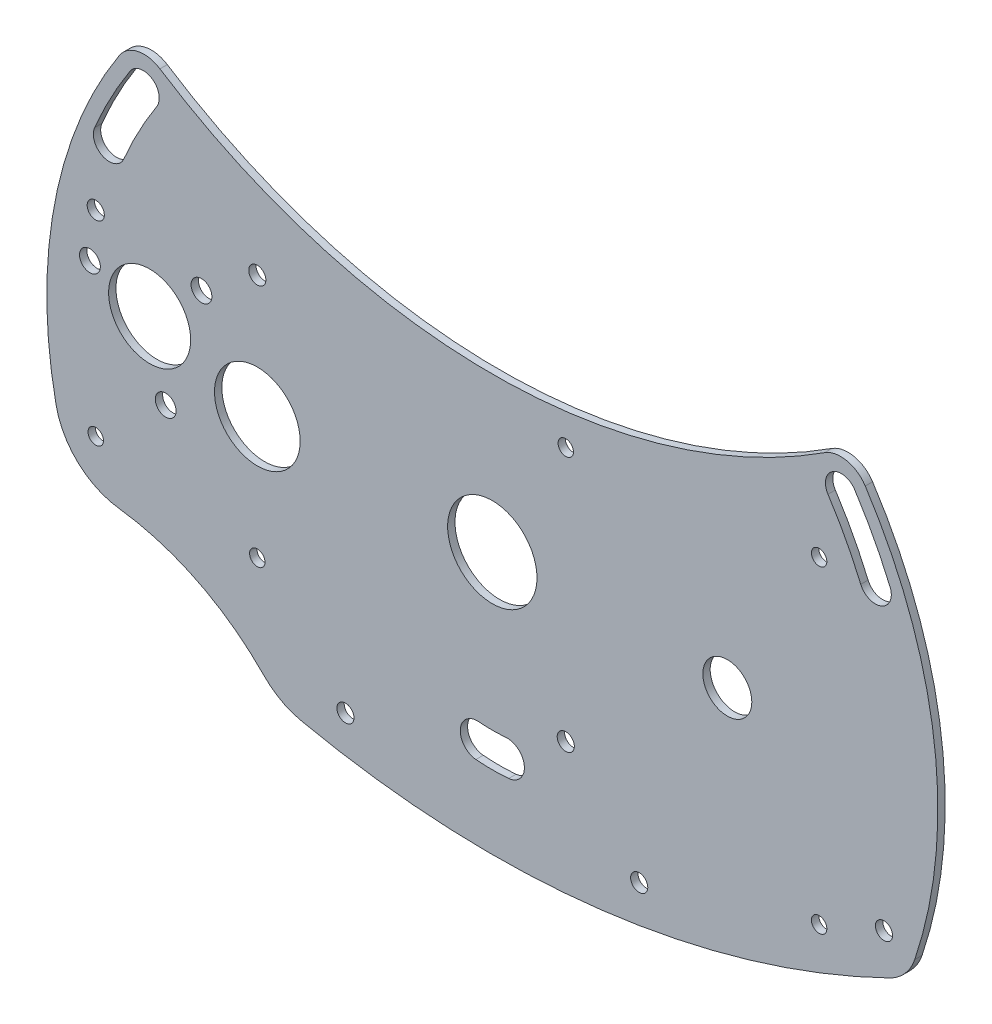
ISO-10303-21;
HEADER;
FILE_DESCRIPTION(('STEP AP214'),'2;1');
FILE_NAME('part.step','',(''),(''),'','','');
FILE_SCHEMA(('AUTOMOTIVE_DESIGN { 1 0 10303 214 1 1 1 1 }'));
ENDSEC;
DATA;
#1=APPLICATION_CONTEXT('core data for automotive mechanical design processes');
#2=APPLICATION_PROTOCOL_DEFINITION('international standard','automotive_design',2000,#1);
#3=PRODUCT_CONTEXT('',#1,'mechanical');
#4=PRODUCT('Part','Part','',(#3));
#5=PRODUCT_RELATED_PRODUCT_CATEGORY('part','',(#4));
#6=PRODUCT_DEFINITION_FORMATION('','',#4);
#7=PRODUCT_DEFINITION_CONTEXT('part definition',#1,'design');
#8=PRODUCT_DEFINITION('design','',#6,#7);
#9=PRODUCT_DEFINITION_SHAPE('','',#8);
#10=(LENGTH_UNIT() NAMED_UNIT(*) SI_UNIT(.MILLI.,.METRE.));
#11=(NAMED_UNIT(*) PLANE_ANGLE_UNIT() SI_UNIT($,.RADIAN.));
#12=(NAMED_UNIT(*) SI_UNIT($,.STERADIAN.) SOLID_ANGLE_UNIT());
#13=UNCERTAINTY_MEASURE_WITH_UNIT(LENGTH_MEASURE(1.E-05),#10,'distance_accuracy_value','');
#14=(GEOMETRIC_REPRESENTATION_CONTEXT(3) GLOBAL_UNCERTAINTY_ASSIGNED_CONTEXT((#13)) GLOBAL_UNIT_ASSIGNED_CONTEXT((#10,
#11,#12)) REPRESENTATION_CONTEXT('',''));
#15=CARTESIAN_POINT('',(0.,0.,0.));
#16=DIRECTION('',(0.,0.,1.));
#17=DIRECTION('',(1.,0.,0.));
#18=AXIS2_PLACEMENT_3D('',#15,#16,#17);
#19=CARTESIAN_POINT('',(71.1493499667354,-109.994408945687,3.));
#20=DIRECTION('',(0.,0.,1.));
#21=DIRECTION('',(1.,0.,0.));
#22=AXIS2_PLACEMENT_3D('',#19,#20,#21);
#23=PLANE('',#22);
#24=CARTESIAN_POINT('',(-60.,-399.892840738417,3.));
#25=DIRECTION('',(0.,0.,1.));
#26=DIRECTION('',(1.,0.,0.));
#27=AXIS2_PLACEMENT_3D('',#24,#25,#26);
#28=CIRCLE('',#27,3.50000000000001);
#29=CARTESIAN_POINT('',(-56.5,-399.892840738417,3.));
#30=VERTEX_POINT('',#29);
#31=EDGE_CURVE('E884',#30,#30,#28,.T.);
#32=ORIENTED_EDGE('',*,*,#31,.F.);
#33=EDGE_LOOP('',(#32));
#34=FACE_BOUND('',#33,.T.);
#35=CARTESIAN_POINT('',(59.9999999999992,-399.892840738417,3.));
#36=DIRECTION('',(0.,0.,1.));
#37=DIRECTION('',(1.,0.,0.));
#38=AXIS2_PLACEMENT_3D('',#35,#36,#37);
#39=CIRCLE('',#38,3.5);
#40=CARTESIAN_POINT('',(63.4999999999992,-399.892840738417,3.));
#41=VERTEX_POINT('',#40);
#42=EDGE_CURVE('E886',#41,#41,#39,.T.);
#43=ORIENTED_EDGE('',*,*,#42,.F.);
#44=EDGE_LOOP('',(#43));
#45=FACE_BOUND('',#44,.T.);
#46=CARTESIAN_POINT('',(159.999999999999,-366.899037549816,3.));
#47=DIRECTION('',(0.,0.,1.));
#48=DIRECTION('',(1.,0.,0.));
#49=AXIS2_PLACEMENT_3D('',#46,#47,#48);
#50=CIRCLE('',#49,3.50000000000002);
#51=CARTESIAN_POINT('',(163.499999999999,-366.899037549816,3.));
#52=VERTEX_POINT('',#51);
#53=EDGE_CURVE('E894',#52,#52,#50,.T.);
#54=ORIENTED_EDGE('',*,*,#53,.F.);
#55=EDGE_LOOP('',(#54));
#56=FACE_BOUND('',#55,.T.);
#57=CARTESIAN_POINT('',(6.10090199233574,-382.733628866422,3.));
#58=DIRECTION('',(0.,0.,1.));
#59=DIRECTION('',(-1.,0.,0.));
#60=AXIS2_PLACEMENT_3D('',#57,#58,#59);
#61=CIRCLE('',#60,7.00000000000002);
#62=CARTESIAN_POINT('',(6.71099219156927,-389.706991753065,3.));
#63=VERTEX_POINT('',#62);
#64=CARTESIAN_POINT('',(5.49081179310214,-375.76026597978,3.));
#65=VERTEX_POINT('',#64);
#66=EDGE_CURVE('E45',#63,#65,#61,.T.);
#67=ORIENTED_EDGE('',*,*,#66,.F.);
#68=CARTESIAN_POINT('',(0.,-313.,3.));
#69=DIRECTION('',(0.,0.,1.));
#70=DIRECTION('',(1.,0.,0.));
#71=AXIS2_PLACEMENT_3D('',#68,#69,#70);
#72=CIRCLE('',#71,77.);
#73=CARTESIAN_POINT('',(-6.71099219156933,-389.706991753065,3.));
#74=VERTEX_POINT('',#73);
#75=EDGE_CURVE('E196',#74,#63,#72,.T.);
#76=ORIENTED_EDGE('',*,*,#75,.F.);
#77=CARTESIAN_POINT('',(-6.10090199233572,-382.733628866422,3.));
#78=DIRECTION('',(0.,0.,1.));
#79=DIRECTION('',(1.,0.,0.));
#80=AXIS2_PLACEMENT_3D('',#77,#78,#79);
#81=CIRCLE('',#80,7.00000000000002);
#82=CARTESIAN_POINT('',(-5.49081179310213,-375.76026597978,3.));
#83=VERTEX_POINT('',#82);
#84=EDGE_CURVE('E181',#83,#74,#81,.T.);
#85=ORIENTED_EDGE('',*,*,#84,.F.);
#86=CARTESIAN_POINT('',(0.,-313.,3.));
#87=DIRECTION('',(0.,0.,-1.));
#88=DIRECTION('',(1.,0.,0.));
#89=AXIS2_PLACEMENT_3D('',#86,#87,#88);
#90=CIRCLE('',#89,63.);
#91=EDGE_CURVE('E190',#65,#83,#90,.T.);
#92=ORIENTED_EDGE('',*,*,#91,.F.);
#93=EDGE_LOOP('',(#67,#76,#85,#92));
#94=FACE_BOUND('',#93,.T.);
#95=CARTESIAN_POINT('',(0.,-313.,3.));
#96=DIRECTION('',(0.,0.,1.));
#97=DIRECTION('',(1.,0.,0.));
#98=AXIS2_PLACEMENT_3D('',#95,#96,#97);
#99=CIRCLE('',#98,176.5);
#100=CARTESIAN_POINT('',(162.469106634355,-244.035955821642,3.));
#101=VERTEX_POINT('',#100);
#102=CARTESIAN_POINT('',(148.025355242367,-216.871210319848,3.));
#103=VERTEX_POINT('',#102);
#104=EDGE_CURVE('E212',#101,#103,#99,.T.);
#105=ORIENTED_EDGE('',*,*,#104,.F.);
#106=CARTESIAN_POINT('',(156.485825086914,-246.575708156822,3.));
#107=DIRECTION('',(0.,0.,1.));
#108=DIRECTION('',(-1.,0.,0.));
#109=AXIS2_PLACEMENT_3D('',#106,#107,#108);
#110=CIRCLE('',#109,6.50000000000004);
#111=CARTESIAN_POINT('',(150.502543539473,-249.115460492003,3.));
#112=VERTEX_POINT('',#111);
#113=EDGE_CURVE('E222',#112,#101,#110,.T.);
#114=ORIENTED_EDGE('',*,*,#113,.F.);
#115=CARTESIAN_POINT('',(0.,-313.,3.));
#116=DIRECTION('',(0.,0.,-1.));
#117=DIRECTION('',(1.,0.,0.));
#118=AXIS2_PLACEMENT_3D('',#115,#116,#117);
#119=CIRCLE('',#118,163.5);
#120=CARTESIAN_POINT('',(137.122637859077,-223.951517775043,3.));
#121=VERTEX_POINT('',#120);
#122=EDGE_CURVE('E219',#121,#112,#119,.T.);
#123=ORIENTED_EDGE('',*,*,#122,.F.);
#124=CARTESIAN_POINT('',(142.573996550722,-220.411364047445,3.));
#125=DIRECTION('',(0.,0.,1.));
#126=DIRECTION('',(1.,0.,0.));
#127=AXIS2_PLACEMENT_3D('',#124,#125,#126);
#128=CIRCLE('',#127,6.50000000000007);
#129=EDGE_CURVE('E216',#103,#121,#128,.T.);
#130=ORIENTED_EDGE('',*,*,#129,.F.);
#131=EDGE_LOOP('',(#105,#114,#123,#130));
#132=FACE_BOUND('',#131,.T.);
#133=CARTESIAN_POINT('',(-156.485825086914,-246.575708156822,3.));
#134=DIRECTION('',(0.,0.,1.));
#135=DIRECTION('',(1.,0.,0.));
#136=AXIS2_PLACEMENT_3D('',#133,#134,#135);
#137=CIRCLE('',#136,6.50000000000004);
#138=CARTESIAN_POINT('',(-162.469106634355,-244.035955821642,3.));
#139=VERTEX_POINT('',#138);
#140=CARTESIAN_POINT('',(-150.502543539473,-249.115460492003,3.));
#141=VERTEX_POINT('',#140);
#142=EDGE_CURVE('E240',#139,#141,#137,.T.);
#143=ORIENTED_EDGE('',*,*,#142,.F.);
#144=CARTESIAN_POINT('',(0.,-313.,3.));
#145=DIRECTION('',(0.,0.,1.));
#146=DIRECTION('',(-1.,0.,0.));
#147=AXIS2_PLACEMENT_3D('',#144,#145,#146);
#148=CIRCLE('',#147,176.5);
#149=CARTESIAN_POINT('',(-148.025355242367,-216.871210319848,3.));
#150=VERTEX_POINT('',#149);
#151=EDGE_CURVE('E254',#150,#139,#148,.T.);
#152=ORIENTED_EDGE('',*,*,#151,.F.);
#153=CARTESIAN_POINT('',(-142.573996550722,-220.411364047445,3.));
#154=DIRECTION('',(0.,0.,1.));
#155=DIRECTION('',(-1.,0.,0.));
#156=AXIS2_PLACEMENT_3D('',#153,#154,#155);
#157=CIRCLE('',#156,6.50000000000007);
#158=CARTESIAN_POINT('',(-137.122637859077,-223.951517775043,3.));
#159=VERTEX_POINT('',#158);
#160=EDGE_CURVE('E251',#159,#150,#157,.T.);
#161=ORIENTED_EDGE('',*,*,#160,.F.);
#162=CARTESIAN_POINT('',(0.,-313.,3.));
#163=DIRECTION('',(0.,0.,-1.));
#164=DIRECTION('',(-1.,0.,0.));
#165=AXIS2_PLACEMENT_3D('',#162,#163,#164);
#166=CIRCLE('',#165,163.5);
#167=EDGE_CURVE('E248',#141,#159,#166,.T.);
#168=ORIENTED_EDGE('',*,*,#167,.F.);
#169=EDGE_LOOP('',(#143,#152,#161,#168));
#170=FACE_BOUND('',#169,.T.);
#171=CARTESIAN_POINT('',(-162.,-353.,3.));
#172=DIRECTION('',(0.,0.,1.));
#173=DIRECTION('',(1.,0.,0.));
#174=AXIS2_PLACEMENT_3D('',#171,#172,#173);
#175=CIRCLE('',#174,3.14999999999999);
#176=CARTESIAN_POINT('',(-158.85,-353.,3.));
#177=VERTEX_POINT('',#176);
#178=EDGE_CURVE('E272',#177,#177,#175,.T.);
#179=ORIENTED_EDGE('',*,*,#178,.F.);
#180=EDGE_LOOP('',(#179));
#181=FACE_BOUND('',#180,.T.);
#182=CARTESIAN_POINT('',(-162.,-273.,3.));
#183=DIRECTION('',(0.,0.,1.));
#184=DIRECTION('',(1.,0.,0.));
#185=AXIS2_PLACEMENT_3D('',#182,#183,#184);
#186=CIRCLE('',#185,3.49999999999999);
#187=CARTESIAN_POINT('',(-158.5,-273.,3.));
#188=VERTEX_POINT('',#187);
#189=EDGE_CURVE('E284',#188,#188,#186,.T.);
#190=ORIENTED_EDGE('',*,*,#189,.F.);
#191=EDGE_LOOP('',(#190));
#192=FACE_BOUND('',#191,.T.);
#193=CARTESIAN_POINT('',(-96.,-363.,3.));
#194=DIRECTION('',(0.,0.,1.));
#195=DIRECTION('',(1.,0.,0.));
#196=AXIS2_PLACEMENT_3D('',#193,#194,#195);
#197=CIRCLE('',#196,3.15);
#198=CARTESIAN_POINT('',(-92.85,-363.,3.));
#199=VERTEX_POINT('',#198);
#200=EDGE_CURVE('E290',#199,#199,#197,.T.);
#201=ORIENTED_EDGE('',*,*,#200,.F.);
#202=EDGE_LOOP('',(#201));
#203=FACE_BOUND('',#202,.T.);
#204=CARTESIAN_POINT('',(-96.,-263.,3.));
#205=DIRECTION('',(0.,0.,1.));
#206=DIRECTION('',(1.,0.,0.));
#207=AXIS2_PLACEMENT_3D('',#204,#205,#206);
#208=CIRCLE('',#207,3.50000000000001);
#209=CARTESIAN_POINT('',(-92.5,-263.,3.));
#210=VERTEX_POINT('',#209);
#211=EDGE_CURVE('E296',#210,#210,#208,.T.);
#212=ORIENTED_EDGE('',*,*,#211,.F.);
#213=EDGE_LOOP('',(#212));
#214=FACE_BOUND('',#213,.T.);
#215=CARTESIAN_POINT('',(133.5,-377.951905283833,3.));
#216=DIRECTION('',(0.,0.,1.));
#217=DIRECTION('',(1.,0.,0.));
#218=AXIS2_PLACEMENT_3D('',#215,#216,#217);
#219=CIRCLE('',#218,3.14999999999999);
#220=CARTESIAN_POINT('',(136.65,-377.951905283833,3.));
#221=VERTEX_POINT('',#220);
#222=EDGE_CURVE('E302',#221,#221,#219,.T.);
#223=ORIENTED_EDGE('',*,*,#222,.F.);
#224=EDGE_LOOP('',(#223));
#225=FACE_BOUND('',#224,.T.);
#226=CARTESIAN_POINT('',(133.5,-248.048094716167,3.));
#227=DIRECTION('',(0.,0.,1.));
#228=DIRECTION('',(1.,0.,0.));
#229=AXIS2_PLACEMENT_3D('',#226,#227,#228);
#230=CIRCLE('',#229,3.14999999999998);
#231=CARTESIAN_POINT('',(136.65,-248.048094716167,3.));
#232=VERTEX_POINT('',#231);
#233=EDGE_CURVE('E308',#232,#232,#230,.T.);
#234=ORIENTED_EDGE('',*,*,#233,.F.);
#235=EDGE_LOOP('',(#234));
#236=FACE_BOUND('',#235,.T.);
#237=CARTESIAN_POINT('',(30.,-365.,3.));
#238=DIRECTION('',(0.,0.,1.));
#239=DIRECTION('',(1.,0.,0.));
#240=AXIS2_PLACEMENT_3D('',#237,#238,#239);
#241=CIRCLE('',#240,3.5);
#242=CARTESIAN_POINT('',(33.5,-365.,3.));
#243=VERTEX_POINT('',#242);
#244=EDGE_CURVE('E314',#243,#243,#241,.T.);
#245=ORIENTED_EDGE('',*,*,#244,.F.);
#246=EDGE_LOOP('',(#245));
#247=FACE_BOUND('',#246,.T.);
#248=CARTESIAN_POINT('',(30.,-261.,3.));
#249=DIRECTION('',(0.,0.,1.));
#250=DIRECTION('',(1.,0.,0.));
#251=AXIS2_PLACEMENT_3D('',#248,#249,#250);
#252=CIRCLE('',#251,3.15000000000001);
#253=CARTESIAN_POINT('',(33.15,-261.,3.));
#254=VERTEX_POINT('',#253);
#255=EDGE_CURVE('E320',#254,#254,#252,.T.);
#256=ORIENTED_EDGE('',*,*,#255,.F.);
#257=EDGE_LOOP('',(#256));
#258=FACE_BOUND('',#257,.T.);
#259=CARTESIAN_POINT('',(-118.814307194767,-279.882672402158,3.));
#260=DIRECTION('',(0.,0.,1.));
#261=DIRECTION('',(1.,0.,0.));
#262=AXIS2_PLACEMENT_3D('',#259,#260,#261);
#263=CIRCLE('',#262,4.25000000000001);
#264=CARTESIAN_POINT('',(-114.564307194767,-279.882672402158,3.));
#265=VERTEX_POINT('',#264);
#266=EDGE_CURVE('E335',#265,#265,#263,.T.);
#267=ORIENTED_EDGE('',*,*,#266,.F.);
#268=EDGE_LOOP('',(#267));
#269=FACE_BOUND('',#268,.T.);
#270=CARTESIAN_POINT('',(-139.9900187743,-299.550901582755,3.));
#271=DIRECTION('',(0.,0.,1.));
#272=DIRECTION('',(1.,0.,0.));
#273=AXIS2_PLACEMENT_3D('',#270,#271,#272);
#274=CIRCLE('',#273,16.75);
#275=CARTESIAN_POINT('',(-123.2400187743,-299.550901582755,3.));
#276=VERTEX_POINT('',#275);
#277=EDGE_CURVE('E347',#276,#276,#274,.T.);
#278=ORIENTED_EDGE('',*,*,#277,.F.);
#279=EDGE_LOOP('',(#278));
#280=FACE_BOUND('',#279,.T.);
#281=CARTESIAN_POINT('',(96.0000000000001,-313.,3.));
#282=DIRECTION('',(0.,0.,1.));
#283=DIRECTION('',(1.,0.,0.));
#284=AXIS2_PLACEMENT_3D('',#281,#282,#283);
#285=CIRCLE('',#284,10.);
#286=CARTESIAN_POINT('',(106.,-313.,3.));
#287=VERTEX_POINT('',#286);
#288=EDGE_CURVE('E359',#287,#287,#285,.T.);
#289=ORIENTED_EDGE('',*,*,#288,.F.);
#290=EDGE_LOOP('',(#289));
#291=FACE_BOUND('',#290,.T.);
#292=CARTESIAN_POINT('',(142.298699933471,-219.988817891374,3.));
#293=DIRECTION('',(0.,0.,1.));
#294=DIRECTION('',(1.,0.,0.));
#295=AXIS2_PLACEMENT_3D('',#292,#293,#294);
#296=CIRCLE('',#295,12.);
#297=CARTESIAN_POINT('',(152.343314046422,-213.423322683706,3.));
#298=VERTEX_POINT('',#297);
#299=CARTESIAN_POINT('',(135.781202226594,-209.912994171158,3.));
#300=VERTEX_POINT('',#299);
#301=EDGE_CURVE('E389',#298,#300,#296,.T.);
#302=ORIENTED_EDGE('',*,*,#301,.T.);
#303=CARTESIAN_POINT('',(0.,0.,3.));
#304=DIRECTION('',(0.,0.,-1.));
#305=DIRECTION('',(-1.,0.,0.));
#306=AXIS2_PLACEMENT_3D('',#303,#304,#305);
#307=CIRCLE('',#306,250.);
#308=CARTESIAN_POINT('',(-135.781202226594,-209.912994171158,3.));
#309=VERTEX_POINT('',#308);
#310=EDGE_CURVE('E392',#300,#309,#307,.T.);
#311=ORIENTED_EDGE('',*,*,#310,.T.);
#312=CARTESIAN_POINT('',(-142.298699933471,-219.988817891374,3.));
#313=DIRECTION('',(0.,0.,1.));
#314=DIRECTION('',(1.,0.,0.));
#315=AXIS2_PLACEMENT_3D('',#312,#313,#314);
#316=CIRCLE('',#315,12.);
#317=CARTESIAN_POINT('',(-152.343314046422,-213.423322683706,3.));
#318=VERTEX_POINT('',#317);
#319=EDGE_CURVE('E394',#309,#318,#316,.T.);
#320=ORIENTED_EDGE('',*,*,#319,.T.);
#321=CARTESIAN_POINT('',(0.,-313.,3.));
#322=DIRECTION('',(0.,0.,1.));
#323=DIRECTION('',(1.,0.,0.));
#324=AXIS2_PLACEMENT_3D('',#321,#322,#323);
#325=CIRCLE('',#324,182.);
#326=CARTESIAN_POINT('',(-178.171449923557,-350.134006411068,3.));
#327=VERTEX_POINT('',#326);
#328=EDGE_CURVE('E396',#318,#327,#325,.T.);
#329=ORIENTED_EDGE('',*,*,#328,.T.);
#330=CARTESIAN_POINT('',(-148.802529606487,-344.01301634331,3.));
#331=DIRECTION('',(0.,0.,1.));
#332=DIRECTION('',(-1.,0.,0.));
#333=AXIS2_PLACEMENT_3D('',#330,#331,#332);
#334=CIRCLE('',#333,30.);
#335=CARTESIAN_POINT('',(-152.540407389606,-373.779243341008,3.));
#336=VERTEX_POINT('',#335);
#337=EDGE_CURVE('E398',#327,#336,#334,.T.);
#338=ORIENTED_EDGE('',*,*,#337,.T.);
#339=CARTESIAN_POINT('',(-165.,-473.,3.));
#340=DIRECTION('',(0.,0.,-1.));
#341=DIRECTION('',(1.,0.,0.));
#342=AXIS2_PLACEMENT_3D('',#339,#340,#341);
#343=CIRCLE('',#342,100.);
#344=CARTESIAN_POINT('',(-93.3436090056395,-403.247855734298,3.));
#345=VERTEX_POINT('',#344);
#346=EDGE_CURVE('E400',#336,#345,#343,.T.);
#347=ORIENTED_EDGE('',*,*,#346,.T.);
#348=CARTESIAN_POINT('',(-71.8466917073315,-382.322212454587,3.));
#349=DIRECTION('',(0.,0.,1.));
#350=DIRECTION('',(-1.,0.,0.));
#351=AXIS2_PLACEMENT_3D('',#348,#349,#350);
#352=CIRCLE('',#351,30.);
#353=CARTESIAN_POINT('',(-78.186105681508,-411.644760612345,3.));
#354=VERTEX_POINT('',#353);
#355=EDGE_CURVE('E402',#345,#354,#352,.T.);
#356=ORIENTED_EDGE('',*,*,#355,.T.);
#357=CARTESIAN_POINT('',(0.,-50.,3.));
#358=DIRECTION('',(0.,0.,1.));
#359=DIRECTION('',(1.,0.,0.));
#360=AXIS2_PLACEMENT_3D('',#357,#358,#359);
#361=CIRCLE('',#360,370.);
#362=CARTESIAN_POINT('',(162.374326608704,-382.467409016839,3.));
#363=VERTEX_POINT('',#362);
#364=EDGE_CURVE('E404',#354,#363,#361,.T.);
#365=ORIENTED_EDGE('',*,*,#364,.T.);
#366=CARTESIAN_POINT('',(153.597335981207,-364.496197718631,3.));
#367=DIRECTION('',(0.,0.,1.));
#368=DIRECTION('',(1.,0.,0.));
#369=AXIS2_PLACEMENT_3D('',#366,#367,#368);
#370=CIRCLE('',#369,20.);
#371=CARTESIAN_POINT('',(172.559970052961,-370.853752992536,3.));
#372=VERTEX_POINT('',#371);
#373=EDGE_CURVE('E406',#363,#372,#370,.T.);
#374=ORIENTED_EDGE('',*,*,#373,.T.);
#375=CARTESIAN_POINT('',(0.,-313.,3.));
#376=DIRECTION('',(0.,0.,1.));
#377=DIRECTION('',(-1.,0.,0.));
#378=AXIS2_PLACEMENT_3D('',#375,#376,#377);
#379=CIRCLE('',#378,182.);
#380=EDGE_CURVE('E408',#372,#298,#379,.T.);
#381=ORIENTED_EDGE('',*,*,#380,.T.);
#382=EDGE_LOOP('',(#302,#311,#320,#329,#338,#347,#356,#365,#374,#381));
#383=FACE_BOUND('',#382,.T.);
#384=CARTESIAN_POINT('',(0.,-313.,3.));
#385=DIRECTION('',(0.,0.,1.));
#386=DIRECTION('',(1.,0.,0.));
#387=AXIS2_PLACEMENT_3D('',#384,#385,#386);
#388=CIRCLE('',#387,18.25);
#389=CARTESIAN_POINT('',(18.2500000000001,-313.,3.));
#390=VERTEX_POINT('',#389);
#391=EDGE_CURVE('E365',#390,#390,#388,.T.);
#392=ORIENTED_EDGE('',*,*,#391,.F.);
#393=EDGE_LOOP('',(#392));
#394=FACE_BOUND('',#393,.T.);
#395=CARTESIAN_POINT('',(-95.9999999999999,-313.,3.));
#396=DIRECTION('',(0.,0.,1.));
#397=DIRECTION('',(1.,0.,0.));
#398=AXIS2_PLACEMENT_3D('',#395,#396,#397);
#399=CIRCLE('',#398,17.5);
#400=CARTESIAN_POINT('',(-78.4999999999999,-313.,3.));
#401=VERTEX_POINT('',#400);
#402=EDGE_CURVE('E353',#401,#401,#399,.T.);
#403=ORIENTED_EDGE('',*,*,#402,.F.);
#404=EDGE_LOOP('',(#403));
#405=FACE_BOUND('',#404,.T.);
#406=CARTESIAN_POINT('',(-164.375790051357,-292.095423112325,3.));
#407=DIRECTION('',(0.,0.,1.));
#408=DIRECTION('',(1.,0.,0.));
#409=AXIS2_PLACEMENT_3D('',#406,#407,#408);
#410=CIRCLE('',#409,4.25000000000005);
#411=CARTESIAN_POINT('',(-160.125790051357,-292.095423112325,3.));
#412=VERTEX_POINT('',#411);
#413=EDGE_CURVE('E341',#412,#412,#410,.T.);
#414=ORIENTED_EDGE('',*,*,#413,.F.);
#415=EDGE_LOOP('',(#414));
#416=FACE_BOUND('',#415,.T.);
#417=CARTESIAN_POINT('',(-133.432892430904,-327.69791020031,3.));
#418=DIRECTION('',(0.,0.,1.));
#419=DIRECTION('',(1.,0.,0.));
#420=AXIS2_PLACEMENT_3D('',#417,#418,#419);
#421=CIRCLE('',#420,4.25000000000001);
#422=CARTESIAN_POINT('',(-129.182892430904,-327.69791020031,3.));
#423=VERTEX_POINT('',#422);
#424=EDGE_CURVE('E329',#423,#423,#421,.T.);
#425=ORIENTED_EDGE('',*,*,#424,.F.);
#426=EDGE_LOOP('',(#425));
#427=FACE_BOUND('',#426,.T.);
#428=ADVANCED_FACE('F30',(#34,#45,#56,#94,#132,#170,#181,#192,#203,#214,#225,#236,#247,#258,
#269,#280,#291,#383,#394,#405,#416,#427),#23,.T.);
#429=CARTESIAN_POINT('',(71.1493499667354,-109.994408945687,0.));
#430=DIRECTION('',(0.,0.,1.));
#431=DIRECTION('',(1.,0.,0.));
#432=AXIS2_PLACEMENT_3D('',#429,#430,#431);
#433=PLANE('',#432);
#434=CARTESIAN_POINT('',(-60.,-399.892840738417,0.));
#435=DIRECTION('',(0.,0.,1.));
#436=DIRECTION('',(1.,0.,0.));
#437=AXIS2_PLACEMENT_3D('',#434,#435,#436);
#438=CIRCLE('',#437,3.50000000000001);
#439=CARTESIAN_POINT('',(-56.5,-399.892840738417,0.));
#440=VERTEX_POINT('',#439);
#441=EDGE_CURVE('E882',#440,#440,#438,.T.);
#442=ORIENTED_EDGE('',*,*,#441,.T.);
#443=EDGE_LOOP('',(#442));
#444=FACE_BOUND('',#443,.T.);
#445=CARTESIAN_POINT('',(59.9999999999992,-399.892840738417,0.));
#446=DIRECTION('',(0.,0.,1.));
#447=DIRECTION('',(1.,0.,0.));
#448=AXIS2_PLACEMENT_3D('',#445,#446,#447);
#449=CIRCLE('',#448,3.5);
#450=CARTESIAN_POINT('',(63.4999999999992,-399.892840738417,0.));
#451=VERTEX_POINT('',#450);
#452=EDGE_CURVE('E891',#451,#451,#449,.T.);
#453=ORIENTED_EDGE('',*,*,#452,.T.);
#454=EDGE_LOOP('',(#453));
#455=FACE_BOUND('',#454,.T.);
#456=CARTESIAN_POINT('',(159.999999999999,-366.899037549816,0.));
#457=DIRECTION('',(0.,0.,1.));
#458=DIRECTION('',(1.,0.,0.));
#459=AXIS2_PLACEMENT_3D('',#456,#457,#458);
#460=CIRCLE('',#459,3.50000000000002);
#461=CARTESIAN_POINT('',(163.499999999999,-366.899037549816,0.));
#462=VERTEX_POINT('',#461);
#463=EDGE_CURVE('E897',#462,#462,#460,.T.);
#464=ORIENTED_EDGE('',*,*,#463,.T.);
#465=EDGE_LOOP('',(#464));
#466=FACE_BOUND('',#465,.T.);
#467=CARTESIAN_POINT('',(0.,-313.,0.));
#468=DIRECTION('',(0.,0.,1.));
#469=DIRECTION('',(1.,0.,0.));
#470=AXIS2_PLACEMENT_3D('',#467,#468,#469);
#471=CIRCLE('',#470,77.);
#472=CARTESIAN_POINT('',(-6.71099219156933,-389.706991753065,0.));
#473=VERTEX_POINT('',#472);
#474=CARTESIAN_POINT('',(6.71099219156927,-389.706991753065,0.));
#475=VERTEX_POINT('',#474);
#476=EDGE_CURVE('E207',#473,#475,#471,.T.);
#477=ORIENTED_EDGE('',*,*,#476,.T.);
#478=CARTESIAN_POINT('',(6.10090199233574,-382.733628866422,0.));
#479=DIRECTION('',(0.,0.,1.));
#480=DIRECTION('',(-1.,0.,0.));
#481=AXIS2_PLACEMENT_3D('',#478,#479,#480);
#482=CIRCLE('',#481,7.00000000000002);
#483=CARTESIAN_POINT('',(5.49081179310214,-375.76026597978,0.));
#484=VERTEX_POINT('',#483);
#485=EDGE_CURVE('E198',#475,#484,#482,.T.);
#486=ORIENTED_EDGE('',*,*,#485,.T.);
#487=CARTESIAN_POINT('',(0.,-313.,0.));
#488=DIRECTION('',(0.,0.,-1.));
#489=DIRECTION('',(1.,0.,0.));
#490=AXIS2_PLACEMENT_3D('',#487,#488,#489);
#491=CIRCLE('',#490,63.);
#492=CARTESIAN_POINT('',(-5.49081179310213,-375.76026597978,0.));
#493=VERTEX_POINT('',#492);
#494=EDGE_CURVE('E204',#484,#493,#491,.T.);
#495=ORIENTED_EDGE('',*,*,#494,.T.);
#496=CARTESIAN_POINT('',(-6.10090199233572,-382.733628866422,0.));
#497=DIRECTION('',(0.,0.,1.));
#498=DIRECTION('',(1.,0.,0.));
#499=AXIS2_PLACEMENT_3D('',#496,#497,#498);
#500=CIRCLE('',#499,7.00000000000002);
#501=EDGE_CURVE('E53',#493,#473,#500,.T.);
#502=ORIENTED_EDGE('',*,*,#501,.T.);
#503=EDGE_LOOP('',(#477,#486,#495,#502));
#504=FACE_BOUND('',#503,.T.);
#505=CARTESIAN_POINT('',(156.485825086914,-246.575708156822,0.));
#506=DIRECTION('',(0.,0.,1.));
#507=DIRECTION('',(-1.,0.,0.));
#508=AXIS2_PLACEMENT_3D('',#505,#506,#507);
#509=CIRCLE('',#508,6.50000000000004);
#510=CARTESIAN_POINT('',(150.502543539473,-249.115460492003,0.));
#511=VERTEX_POINT('',#510);
#512=CARTESIAN_POINT('',(162.469106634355,-244.035955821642,0.));
#513=VERTEX_POINT('',#512);
#514=EDGE_CURVE('E234',#511,#513,#509,.T.);
#515=ORIENTED_EDGE('',*,*,#514,.T.);
#516=CARTESIAN_POINT('',(0.,-313.,0.));
#517=DIRECTION('',(0.,0.,1.));
#518=DIRECTION('',(1.,0.,0.));
#519=AXIS2_PLACEMENT_3D('',#516,#517,#518);
#520=CIRCLE('',#519,176.5);
#521=CARTESIAN_POINT('',(148.025355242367,-216.871210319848,0.));
#522=VERTEX_POINT('',#521);
#523=EDGE_CURVE('E225',#513,#522,#520,.T.);
#524=ORIENTED_EDGE('',*,*,#523,.T.);
#525=CARTESIAN_POINT('',(142.573996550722,-220.411364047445,0.));
#526=DIRECTION('',(0.,0.,1.));
#527=DIRECTION('',(1.,0.,0.));
#528=AXIS2_PLACEMENT_3D('',#525,#526,#527);
#529=CIRCLE('',#528,6.50000000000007);
#530=CARTESIAN_POINT('',(137.122637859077,-223.951517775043,0.));
#531=VERTEX_POINT('',#530);
#532=EDGE_CURVE('E228',#522,#531,#529,.T.);
#533=ORIENTED_EDGE('',*,*,#532,.T.);
#534=CARTESIAN_POINT('',(0.,-313.,0.));
#535=DIRECTION('',(0.,0.,-1.));
#536=DIRECTION('',(1.,0.,0.));
#537=AXIS2_PLACEMENT_3D('',#534,#535,#536);
#538=CIRCLE('',#537,163.5);
#539=EDGE_CURVE('E231',#531,#511,#538,.T.);
#540=ORIENTED_EDGE('',*,*,#539,.T.);
#541=EDGE_LOOP('',(#515,#524,#533,#540));
#542=FACE_BOUND('',#541,.T.);
#543=CARTESIAN_POINT('',(0.,-313.,0.));
#544=DIRECTION('',(0.,0.,1.));
#545=DIRECTION('',(-1.,0.,0.));
#546=AXIS2_PLACEMENT_3D('',#543,#544,#545);
#547=CIRCLE('',#546,176.5);
#548=CARTESIAN_POINT('',(-148.025355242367,-216.871210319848,0.));
#549=VERTEX_POINT('',#548);
#550=CARTESIAN_POINT('',(-162.469106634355,-244.035955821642,0.));
#551=VERTEX_POINT('',#550);
#552=EDGE_CURVE('E266',#549,#551,#547,.T.);
#553=ORIENTED_EDGE('',*,*,#552,.T.);
#554=CARTESIAN_POINT('',(-156.485825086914,-246.575708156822,0.));
#555=DIRECTION('',(0.,0.,1.));
#556=DIRECTION('',(1.,0.,0.));
#557=AXIS2_PLACEMENT_3D('',#554,#555,#556);
#558=CIRCLE('',#557,6.50000000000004);
#559=CARTESIAN_POINT('',(-150.502543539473,-249.115460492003,0.));
#560=VERTEX_POINT('',#559);
#561=EDGE_CURVE('E257',#551,#560,#558,.T.);
#562=ORIENTED_EDGE('',*,*,#561,.T.);
#563=CARTESIAN_POINT('',(0.,-313.,0.));
#564=DIRECTION('',(0.,0.,-1.));
#565=DIRECTION('',(-1.,0.,0.));
#566=AXIS2_PLACEMENT_3D('',#563,#564,#565);
#567=CIRCLE('',#566,163.5);
#568=CARTESIAN_POINT('',(-137.122637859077,-223.951517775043,0.));
#569=VERTEX_POINT('',#568);
#570=EDGE_CURVE('E260',#560,#569,#567,.T.);
#571=ORIENTED_EDGE('',*,*,#570,.T.);
#572=CARTESIAN_POINT('',(-142.573996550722,-220.411364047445,0.));
#573=DIRECTION('',(0.,0.,1.));
#574=DIRECTION('',(-1.,0.,0.));
#575=AXIS2_PLACEMENT_3D('',#572,#573,#574);
#576=CIRCLE('',#575,6.50000000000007);
#577=EDGE_CURVE('E263',#569,#549,#576,.T.);
#578=ORIENTED_EDGE('',*,*,#577,.T.);
#579=EDGE_LOOP('',(#553,#562,#571,#578));
#580=FACE_BOUND('',#579,.T.);
#581=CARTESIAN_POINT('',(-162.,-353.,0.));
#582=DIRECTION('',(0.,0.,1.));
#583=DIRECTION('',(1.,0.,0.));
#584=AXIS2_PLACEMENT_3D('',#581,#582,#583);
#585=CIRCLE('',#584,3.14999999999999);
#586=CARTESIAN_POINT('',(-158.85,-353.,0.));
#587=VERTEX_POINT('',#586);
#588=EDGE_CURVE('E281',#587,#587,#585,.T.);
#589=ORIENTED_EDGE('',*,*,#588,.T.);
#590=EDGE_LOOP('',(#589));
#591=FACE_BOUND('',#590,.T.);
#592=CARTESIAN_POINT('',(-162.,-273.,0.));
#593=DIRECTION('',(0.,0.,1.));
#594=DIRECTION('',(1.,0.,0.));
#595=AXIS2_PLACEMENT_3D('',#592,#593,#594);
#596=CIRCLE('',#595,3.49999999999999);
#597=CARTESIAN_POINT('',(-158.5,-273.,0.));
#598=VERTEX_POINT('',#597);
#599=EDGE_CURVE('E287',#598,#598,#596,.T.);
#600=ORIENTED_EDGE('',*,*,#599,.T.);
#601=EDGE_LOOP('',(#600));
#602=FACE_BOUND('',#601,.T.);
#603=CARTESIAN_POINT('',(-96.,-363.,0.));
#604=DIRECTION('',(0.,0.,1.));
#605=DIRECTION('',(1.,0.,0.));
#606=AXIS2_PLACEMENT_3D('',#603,#604,#605);
#607=CIRCLE('',#606,3.15);
#608=CARTESIAN_POINT('',(-92.85,-363.,0.));
#609=VERTEX_POINT('',#608);
#610=EDGE_CURVE('E293',#609,#609,#607,.T.);
#611=ORIENTED_EDGE('',*,*,#610,.T.);
#612=EDGE_LOOP('',(#611));
#613=FACE_BOUND('',#612,.T.);
#614=CARTESIAN_POINT('',(-96.,-263.,0.));
#615=DIRECTION('',(0.,0.,1.));
#616=DIRECTION('',(1.,0.,0.));
#617=AXIS2_PLACEMENT_3D('',#614,#615,#616);
#618=CIRCLE('',#617,3.50000000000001);
#619=CARTESIAN_POINT('',(-92.5,-263.,0.));
#620=VERTEX_POINT('',#619);
#621=EDGE_CURVE('E299',#620,#620,#618,.T.);
#622=ORIENTED_EDGE('',*,*,#621,.T.);
#623=EDGE_LOOP('',(#622));
#624=FACE_BOUND('',#623,.T.);
#625=CARTESIAN_POINT('',(133.5,-377.951905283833,0.));
#626=DIRECTION('',(0.,0.,1.));
#627=DIRECTION('',(1.,0.,0.));
#628=AXIS2_PLACEMENT_3D('',#625,#626,#627);
#629=CIRCLE('',#628,3.14999999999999);
#630=CARTESIAN_POINT('',(136.65,-377.951905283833,0.));
#631=VERTEX_POINT('',#630);
#632=EDGE_CURVE('E305',#631,#631,#629,.T.);
#633=ORIENTED_EDGE('',*,*,#632,.T.);
#634=EDGE_LOOP('',(#633));
#635=FACE_BOUND('',#634,.T.);
#636=CARTESIAN_POINT('',(133.5,-248.048094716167,0.));
#637=DIRECTION('',(0.,0.,1.));
#638=DIRECTION('',(1.,0.,0.));
#639=AXIS2_PLACEMENT_3D('',#636,#637,#638);
#640=CIRCLE('',#639,3.14999999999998);
#641=CARTESIAN_POINT('',(136.65,-248.048094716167,0.));
#642=VERTEX_POINT('',#641);
#643=EDGE_CURVE('E311',#642,#642,#640,.T.);
#644=ORIENTED_EDGE('',*,*,#643,.T.);
#645=EDGE_LOOP('',(#644));
#646=FACE_BOUND('',#645,.T.);
#647=CARTESIAN_POINT('',(30.,-365.,0.));
#648=DIRECTION('',(0.,0.,1.));
#649=DIRECTION('',(1.,0.,0.));
#650=AXIS2_PLACEMENT_3D('',#647,#648,#649);
#651=CIRCLE('',#650,3.5);
#652=CARTESIAN_POINT('',(33.5,-365.,0.));
#653=VERTEX_POINT('',#652);
#654=EDGE_CURVE('E317',#653,#653,#651,.T.);
#655=ORIENTED_EDGE('',*,*,#654,.T.);
#656=EDGE_LOOP('',(#655));
#657=FACE_BOUND('',#656,.T.);
#658=CARTESIAN_POINT('',(30.,-261.,0.));
#659=DIRECTION('',(0.,0.,1.));
#660=DIRECTION('',(1.,0.,0.));
#661=AXIS2_PLACEMENT_3D('',#658,#659,#660);
#662=CIRCLE('',#661,3.15000000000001);
#663=CARTESIAN_POINT('',(33.15,-261.,0.));
#664=VERTEX_POINT('',#663);
#665=EDGE_CURVE('E323',#664,#664,#662,.T.);
#666=ORIENTED_EDGE('',*,*,#665,.T.);
#667=EDGE_LOOP('',(#666));
#668=FACE_BOUND('',#667,.T.);
#669=CARTESIAN_POINT('',(-118.814307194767,-279.882672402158,0.));
#670=DIRECTION('',(0.,0.,1.));
#671=DIRECTION('',(1.,0.,0.));
#672=AXIS2_PLACEMENT_3D('',#669,#670,#671);
#673=CIRCLE('',#672,4.25000000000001);
#674=CARTESIAN_POINT('',(-114.564307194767,-279.882672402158,0.));
#675=VERTEX_POINT('',#674);
#676=EDGE_CURVE('E332',#675,#675,#673,.T.);
#677=ORIENTED_EDGE('',*,*,#676,.T.);
#678=EDGE_LOOP('',(#677));
#679=FACE_BOUND('',#678,.T.);
#680=CARTESIAN_POINT('',(-139.9900187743,-299.550901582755,0.));
#681=DIRECTION('',(0.,0.,1.));
#682=DIRECTION('',(1.,0.,0.));
#683=AXIS2_PLACEMENT_3D('',#680,#681,#682);
#684=CIRCLE('',#683,16.75);
#685=CARTESIAN_POINT('',(-123.2400187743,-299.550901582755,0.));
#686=VERTEX_POINT('',#685);
#687=EDGE_CURVE('E344',#686,#686,#684,.T.);
#688=ORIENTED_EDGE('',*,*,#687,.T.);
#689=EDGE_LOOP('',(#688));
#690=FACE_BOUND('',#689,.T.);
#691=CARTESIAN_POINT('',(96.0000000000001,-313.,0.));
#692=DIRECTION('',(0.,0.,1.));
#693=DIRECTION('',(1.,0.,0.));
#694=AXIS2_PLACEMENT_3D('',#691,#692,#693);
#695=CIRCLE('',#694,10.);
#696=CARTESIAN_POINT('',(106.,-313.,0.));
#697=VERTEX_POINT('',#696);
#698=EDGE_CURVE('E356',#697,#697,#695,.T.);
#699=ORIENTED_EDGE('',*,*,#698,.T.);
#700=EDGE_LOOP('',(#699));
#701=FACE_BOUND('',#700,.T.);
#702=CARTESIAN_POINT('',(142.298699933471,-219.988817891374,0.));
#703=DIRECTION('',(0.,0.,1.));
#704=DIRECTION('',(1.,0.,0.));
#705=AXIS2_PLACEMENT_3D('',#702,#703,#704);
#706=CIRCLE('',#705,12.);
#707=CARTESIAN_POINT('',(152.343314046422,-213.423322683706,0.));
#708=VERTEX_POINT('',#707);
#709=CARTESIAN_POINT('',(135.781202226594,-209.912994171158,0.));
#710=VERTEX_POINT('',#709);
#711=EDGE_CURVE('E368',#708,#710,#706,.T.);
#712=ORIENTED_EDGE('',*,*,#711,.F.);
#713=CARTESIAN_POINT('',(0.,-313.,0.));
#714=DIRECTION('',(0.,0.,1.));
#715=DIRECTION('',(-1.,0.,0.));
#716=AXIS2_PLACEMENT_3D('',#713,#714,#715);
#717=CIRCLE('',#716,182.);
#718=CARTESIAN_POINT('',(172.559970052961,-370.853752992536,0.));
#719=VERTEX_POINT('',#718);
#720=EDGE_CURVE('E387',#719,#708,#717,.T.);
#721=ORIENTED_EDGE('',*,*,#720,.F.);
#722=CARTESIAN_POINT('',(153.597335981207,-364.496197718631,0.));
#723=DIRECTION('',(0.,0.,1.));
#724=DIRECTION('',(1.,0.,0.));
#725=AXIS2_PLACEMENT_3D('',#722,#723,#724);
#726=CIRCLE('',#725,20.);
#727=CARTESIAN_POINT('',(162.374326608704,-382.467409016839,0.));
#728=VERTEX_POINT('',#727);
#729=EDGE_CURVE('E385',#728,#719,#726,.T.);
#730=ORIENTED_EDGE('',*,*,#729,.F.);
#731=CARTESIAN_POINT('',(0.,-50.,0.));
#732=DIRECTION('',(0.,0.,1.));
#733=DIRECTION('',(1.,0.,0.));
#734=AXIS2_PLACEMENT_3D('',#731,#732,#733);
#735=CIRCLE('',#734,370.);
#736=CARTESIAN_POINT('',(-78.186105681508,-411.644760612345,0.));
#737=VERTEX_POINT('',#736);
#738=EDGE_CURVE('E383',#737,#728,#735,.T.);
#739=ORIENTED_EDGE('',*,*,#738,.F.);
#740=CARTESIAN_POINT('',(-71.8466917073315,-382.322212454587,0.));
#741=DIRECTION('',(0.,0.,1.));
#742=DIRECTION('',(-1.,0.,0.));
#743=AXIS2_PLACEMENT_3D('',#740,#741,#742);
#744=CIRCLE('',#743,30.);
#745=CARTESIAN_POINT('',(-93.3436090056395,-403.247855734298,0.));
#746=VERTEX_POINT('',#745);
#747=EDGE_CURVE('E381',#746,#737,#744,.T.);
#748=ORIENTED_EDGE('',*,*,#747,.F.);
#749=CARTESIAN_POINT('',(-165.,-473.,0.));
#750=DIRECTION('',(0.,0.,-1.));
#751=DIRECTION('',(1.,0.,0.));
#752=AXIS2_PLACEMENT_3D('',#749,#750,#751);
#753=CIRCLE('',#752,100.);
#754=CARTESIAN_POINT('',(-152.540407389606,-373.779243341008,0.));
#755=VERTEX_POINT('',#754);
#756=EDGE_CURVE('E379',#755,#746,#753,.T.);
#757=ORIENTED_EDGE('',*,*,#756,.F.);
#758=CARTESIAN_POINT('',(-148.802529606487,-344.01301634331,0.));
#759=DIRECTION('',(0.,0.,1.));
#760=DIRECTION('',(-1.,0.,0.));
#761=AXIS2_PLACEMENT_3D('',#758,#759,#760);
#762=CIRCLE('',#761,30.);
#763=CARTESIAN_POINT('',(-178.171449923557,-350.134006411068,0.));
#764=VERTEX_POINT('',#763);
#765=EDGE_CURVE('E377',#764,#755,#762,.T.);
#766=ORIENTED_EDGE('',*,*,#765,.F.);
#767=CARTESIAN_POINT('',(0.,-313.,0.));
#768=DIRECTION('',(0.,0.,1.));
#769=DIRECTION('',(1.,0.,0.));
#770=AXIS2_PLACEMENT_3D('',#767,#768,#769);
#771=CIRCLE('',#770,182.);
#772=CARTESIAN_POINT('',(-152.343314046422,-213.423322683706,0.));
#773=VERTEX_POINT('',#772);
#774=EDGE_CURVE('E375',#773,#764,#771,.T.);
#775=ORIENTED_EDGE('',*,*,#774,.F.);
#776=CARTESIAN_POINT('',(-142.298699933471,-219.988817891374,0.));
#777=DIRECTION('',(0.,0.,1.));
#778=DIRECTION('',(1.,0.,0.));
#779=AXIS2_PLACEMENT_3D('',#776,#777,#778);
#780=CIRCLE('',#779,12.);
#781=CARTESIAN_POINT('',(-135.781202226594,-209.912994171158,0.));
#782=VERTEX_POINT('',#781);
#783=EDGE_CURVE('E373',#782,#773,#780,.T.);
#784=ORIENTED_EDGE('',*,*,#783,.F.);
#785=CARTESIAN_POINT('',(0.,0.,0.));
#786=DIRECTION('',(0.,0.,-1.));
#787=DIRECTION('',(-1.,0.,0.));
#788=AXIS2_PLACEMENT_3D('',#785,#786,#787);
#789=CIRCLE('',#788,250.);
#790=EDGE_CURVE('E371',#710,#782,#789,.T.);
#791=ORIENTED_EDGE('',*,*,#790,.F.);
#792=EDGE_LOOP('',(#712,#721,#730,#739,#748,#757,#766,#775,#784,#791));
#793=FACE_BOUND('',#792,.T.);
#794=CARTESIAN_POINT('',(0.,-313.,0.));
#795=DIRECTION('',(0.,0.,1.));
#796=DIRECTION('',(1.,0.,0.));
#797=AXIS2_PLACEMENT_3D('',#794,#795,#796);
#798=CIRCLE('',#797,18.25);
#799=CARTESIAN_POINT('',(18.2500000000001,-313.,0.));
#800=VERTEX_POINT('',#799);
#801=EDGE_CURVE('E362',#800,#800,#798,.T.);
#802=ORIENTED_EDGE('',*,*,#801,.T.);
#803=EDGE_LOOP('',(#802));
#804=FACE_BOUND('',#803,.T.);
#805=CARTESIAN_POINT('',(-95.9999999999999,-313.,0.));
#806=DIRECTION('',(0.,0.,1.));
#807=DIRECTION('',(1.,0.,0.));
#808=AXIS2_PLACEMENT_3D('',#805,#806,#807);
#809=CIRCLE('',#808,17.5);
#810=CARTESIAN_POINT('',(-78.4999999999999,-313.,0.));
#811=VERTEX_POINT('',#810);
#812=EDGE_CURVE('E350',#811,#811,#809,.T.);
#813=ORIENTED_EDGE('',*,*,#812,.T.);
#814=EDGE_LOOP('',(#813));
#815=FACE_BOUND('',#814,.T.);
#816=CARTESIAN_POINT('',(-164.375790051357,-292.095423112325,0.));
#817=DIRECTION('',(0.,0.,1.));
#818=DIRECTION('',(1.,0.,0.));
#819=AXIS2_PLACEMENT_3D('',#816,#817,#818);
#820=CIRCLE('',#819,4.25000000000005);
#821=CARTESIAN_POINT('',(-160.125790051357,-292.095423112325,0.));
#822=VERTEX_POINT('',#821);
#823=EDGE_CURVE('E338',#822,#822,#820,.T.);
#824=ORIENTED_EDGE('',*,*,#823,.T.);
#825=EDGE_LOOP('',(#824));
#826=FACE_BOUND('',#825,.T.);
#827=CARTESIAN_POINT('',(-133.432892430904,-327.69791020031,0.));
#828=DIRECTION('',(0.,0.,1.));
#829=DIRECTION('',(1.,0.,0.));
#830=AXIS2_PLACEMENT_3D('',#827,#828,#829);
#831=CIRCLE('',#830,4.25000000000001);
#832=CARTESIAN_POINT('',(-129.182892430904,-327.69791020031,0.));
#833=VERTEX_POINT('',#832);
#834=EDGE_CURVE('E326',#833,#833,#831,.T.);
#835=ORIENTED_EDGE('',*,*,#834,.T.);
#836=EDGE_LOOP('',(#835));
#837=FACE_BOUND('',#836,.T.);
#838=ADVANCED_FACE('F444',(#444,#455,#466,#504,#542,#580,#591,#602,#613,#624,#635,#646,#657,
#668,#679,#690,#701,#793,#804,#815,#826,#837),#433,.F.);
#839=CARTESIAN_POINT('',(142.298699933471,-219.988817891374,3.));
#840=DIRECTION('',(0.,0.,-1.));
#841=DIRECTION('',(-1.,0.,0.));
#842=AXIS2_PLACEMENT_3D('',#839,#840,#841);
#843=CYLINDRICAL_SURFACE('',#842,12.);
#844=ORIENTED_EDGE('',*,*,#711,.T.);
#845=DIRECTION('',(0.,0.,-1.));
#846=VECTOR('',#845,1.);
#847=CARTESIAN_POINT('',(135.781202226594,-209.912994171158,3.));
#848=LINE('',#847,#846);
#849=EDGE_CURVE('E11',#300,#710,#848,.T.);
#850=ORIENTED_EDGE('',*,*,#849,.F.);
#851=ORIENTED_EDGE('',*,*,#301,.F.);
#852=DIRECTION('',(0.,0.,-1.));
#853=VECTOR('',#852,1.);
#854=CARTESIAN_POINT('',(152.343314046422,-213.423322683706,3.));
#855=LINE('',#854,#853);
#856=EDGE_CURVE('E410',#298,#708,#855,.T.);
#857=ORIENTED_EDGE('',*,*,#856,.T.);
#858=EDGE_LOOP('',(#844,#850,#851,#857));
#859=FACE_BOUND('',#858,.T.);
#860=ADVANCED_FACE('F32',(#859),#843,.T.);
#861=CARTESIAN_POINT('',(0.,0.,3.));
#862=DIRECTION('',(0.,0.,-1.));
#863=DIRECTION('',(-1.,0.,0.));
#864=AXIS2_PLACEMENT_3D('',#861,#862,#863);
#865=CYLINDRICAL_SURFACE('',#864,250.);
#866=ORIENTED_EDGE('',*,*,#790,.T.);
#867=DIRECTION('',(0.,0.,-1.));
#868=VECTOR('',#867,1.);
#869=CARTESIAN_POINT('',(-135.781202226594,-209.912994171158,3.));
#870=LINE('',#869,#868);
#871=EDGE_CURVE('E38',#309,#782,#870,.T.);
#872=ORIENTED_EDGE('',*,*,#871,.F.);
#873=ORIENTED_EDGE('',*,*,#310,.F.);
#874=ORIENTED_EDGE('',*,*,#849,.T.);
#875=EDGE_LOOP('',(#866,#872,#873,#874));
#876=FACE_BOUND('',#875,.T.);
#877=ADVANCED_FACE('F462',(#876),#865,.F.);
#878=CARTESIAN_POINT('',(-142.298699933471,-219.988817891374,3.));
#879=DIRECTION('',(0.,0.,-1.));
#880=DIRECTION('',(-1.,0.,0.));
#881=AXIS2_PLACEMENT_3D('',#878,#879,#880);
#882=CYLINDRICAL_SURFACE('',#881,12.);
#883=ORIENTED_EDGE('',*,*,#783,.T.);
#884=DIRECTION('',(0.,0.,-1.));
#885=VECTOR('',#884,1.);
#886=CARTESIAN_POINT('',(-152.343314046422,-213.423322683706,3.));
#887=LINE('',#886,#885);
#888=EDGE_CURVE('E431',#318,#773,#887,.T.);
#889=ORIENTED_EDGE('',*,*,#888,.F.);
#890=ORIENTED_EDGE('',*,*,#319,.F.);
#891=ORIENTED_EDGE('',*,*,#871,.T.);
#892=EDGE_LOOP('',(#883,#889,#890,#891));
#893=FACE_BOUND('',#892,.T.);
#894=ADVANCED_FACE('F438',(#893),#882,.T.);
#895=CARTESIAN_POINT('',(0.,-313.,3.));
#896=DIRECTION('',(0.,0.,-1.));
#897=DIRECTION('',(-1.,0.,0.));
#898=AXIS2_PLACEMENT_3D('',#895,#896,#897);
#899=CYLINDRICAL_SURFACE('',#898,182.);
#900=ORIENTED_EDGE('',*,*,#774,.T.);
#901=DIRECTION('',(0.,0.,-1.));
#902=VECTOR('',#901,1.);
#903=CARTESIAN_POINT('',(-178.171449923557,-350.134006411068,3.));
#904=LINE('',#903,#902);
#905=EDGE_CURVE('E428',#327,#764,#904,.T.);
#906=ORIENTED_EDGE('',*,*,#905,.F.);
#907=ORIENTED_EDGE('',*,*,#328,.F.);
#908=ORIENTED_EDGE('',*,*,#888,.T.);
#909=EDGE_LOOP('',(#900,#906,#907,#908));
#910=FACE_BOUND('',#909,.T.);
#911=ADVANCED_FACE('F450',(#910),#899,.T.);
#912=CARTESIAN_POINT('',(-148.802529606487,-344.01301634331,3.));
#913=DIRECTION('',(0.,0.,-1.));
#914=DIRECTION('',(-1.,0.,0.));
#915=AXIS2_PLACEMENT_3D('',#912,#913,#914);
#916=CYLINDRICAL_SURFACE('',#915,30.);
#917=ORIENTED_EDGE('',*,*,#765,.T.);
#918=DIRECTION('',(0.,0.,-1.));
#919=VECTOR('',#918,1.);
#920=CARTESIAN_POINT('',(-152.540407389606,-373.779243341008,3.));
#921=LINE('',#920,#919);
#922=EDGE_CURVE('E425',#336,#755,#921,.T.);
#923=ORIENTED_EDGE('',*,*,#922,.F.);
#924=ORIENTED_EDGE('',*,*,#337,.F.);
#925=ORIENTED_EDGE('',*,*,#905,.T.);
#926=EDGE_LOOP('',(#917,#923,#924,#925));
#927=FACE_BOUND('',#926,.T.);
#928=ADVANCED_FACE('F454',(#927),#916,.T.);
#929=CARTESIAN_POINT('',(-165.,-473.,3.));
#930=DIRECTION('',(0.,0.,-1.));
#931=DIRECTION('',(-1.,0.,0.));
#932=AXIS2_PLACEMENT_3D('',#929,#930,#931);
#933=CYLINDRICAL_SURFACE('',#932,100.);
#934=ORIENTED_EDGE('',*,*,#756,.T.);
#935=DIRECTION('',(0.,0.,-1.));
#936=VECTOR('',#935,1.);
#937=CARTESIAN_POINT('',(-93.3436090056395,-403.247855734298,3.));
#938=LINE('',#937,#936);
#939=EDGE_CURVE('E422',#345,#746,#938,.T.);
#940=ORIENTED_EDGE('',*,*,#939,.F.);
#941=ORIENTED_EDGE('',*,*,#346,.F.);
#942=ORIENTED_EDGE('',*,*,#922,.T.);
#943=EDGE_LOOP('',(#934,#940,#941,#942));
#944=FACE_BOUND('',#943,.T.);
#945=ADVANCED_FACE('F485',(#944),#933,.F.);
#946=CARTESIAN_POINT('',(-71.8466917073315,-382.322212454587,3.));
#947=DIRECTION('',(0.,0.,-1.));
#948=DIRECTION('',(-1.,0.,0.));
#949=AXIS2_PLACEMENT_3D('',#946,#947,#948);
#950=CYLINDRICAL_SURFACE('',#949,30.);
#951=ORIENTED_EDGE('',*,*,#747,.T.);
#952=DIRECTION('',(0.,0.,-1.));
#953=VECTOR('',#952,1.);
#954=CARTESIAN_POINT('',(-78.186105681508,-411.644760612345,3.));
#955=LINE('',#954,#953);
#956=EDGE_CURVE('E419',#354,#737,#955,.T.);
#957=ORIENTED_EDGE('',*,*,#956,.F.);
#958=ORIENTED_EDGE('',*,*,#355,.F.);
#959=ORIENTED_EDGE('',*,*,#939,.T.);
#960=EDGE_LOOP('',(#951,#957,#958,#959));
#961=FACE_BOUND('',#960,.T.);
#962=ADVANCED_FACE('F482',(#961),#950,.T.);
#963=CARTESIAN_POINT('',(0.,-50.,3.));
#964=DIRECTION('',(0.,0.,-1.));
#965=DIRECTION('',(-1.,0.,0.));
#966=AXIS2_PLACEMENT_3D('',#963,#964,#965);
#967=CYLINDRICAL_SURFACE('',#966,370.);
#968=ORIENTED_EDGE('',*,*,#738,.T.);
#969=DIRECTION('',(0.,0.,-1.));
#970=VECTOR('',#969,1.);
#971=CARTESIAN_POINT('',(162.374326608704,-382.467409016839,3.));
#972=LINE('',#971,#970);
#973=EDGE_CURVE('E416',#363,#728,#972,.T.);
#974=ORIENTED_EDGE('',*,*,#973,.F.);
#975=ORIENTED_EDGE('',*,*,#364,.F.);
#976=ORIENTED_EDGE('',*,*,#956,.T.);
#977=EDGE_LOOP('',(#968,#974,#975,#976));
#978=FACE_BOUND('',#977,.T.);
#979=ADVANCED_FACE('F478',(#978),#967,.T.);
#980=CARTESIAN_POINT('',(153.597335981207,-364.496197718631,3.));
#981=DIRECTION('',(0.,0.,-1.));
#982=DIRECTION('',(-1.,0.,0.));
#983=AXIS2_PLACEMENT_3D('',#980,#981,#982);
#984=CYLINDRICAL_SURFACE('',#983,20.);
#985=ORIENTED_EDGE('',*,*,#729,.T.);
#986=DIRECTION('',(0.,0.,-1.));
#987=VECTOR('',#986,1.);
#988=CARTESIAN_POINT('',(172.559970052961,-370.853752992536,3.));
#989=LINE('',#988,#987);
#990=EDGE_CURVE('E413',#372,#719,#989,.T.);
#991=ORIENTED_EDGE('',*,*,#990,.F.);
#992=ORIENTED_EDGE('',*,*,#373,.F.);
#993=ORIENTED_EDGE('',*,*,#973,.T.);
#994=EDGE_LOOP('',(#985,#991,#992,#993));
#995=FACE_BOUND('',#994,.T.);
#996=ADVANCED_FACE('F474',(#995),#984,.T.);
#997=CARTESIAN_POINT('',(0.,-313.,3.));
#998=DIRECTION('',(0.,0.,-1.));
#999=DIRECTION('',(-1.,0.,0.));
#1000=AXIS2_PLACEMENT_3D('',#997,#998,#999);
#1001=CYLINDRICAL_SURFACE('',#1000,182.);
#1002=ORIENTED_EDGE('',*,*,#720,.T.);
#1003=ORIENTED_EDGE('',*,*,#856,.F.);
#1004=ORIENTED_EDGE('',*,*,#380,.F.);
#1005=ORIENTED_EDGE('',*,*,#990,.T.);
#1006=EDGE_LOOP('',(#1002,#1003,#1004,#1005));
#1007=FACE_BOUND('',#1006,.T.);
#1008=ADVANCED_FACE('F469',(#1007),#1001,.T.);
#1009=CARTESIAN_POINT('',(0.,-313.,3.));
#1010=DIRECTION('',(0.,0.,-1.));
#1011=DIRECTION('',(-1.,0.,0.));
#1012=AXIS2_PLACEMENT_3D('',#1009,#1010,#1011);
#1013=CYLINDRICAL_SURFACE('',#1012,18.25);
#1014=ORIENTED_EDGE('',*,*,#391,.T.);
#1015=EDGE_LOOP('',(#1014));
#1016=FACE_BOUND('',#1015,.T.);
#1017=ORIENTED_EDGE('',*,*,#801,.F.);
#1018=EDGE_LOOP('',(#1017));
#1019=FACE_BOUND('',#1018,.T.);
#1020=ADVANCED_FACE('F508',(#1016,#1019),#1013,.F.);
#1021=CARTESIAN_POINT('',(96.0000000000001,-313.,3.));
#1022=DIRECTION('',(0.,0.,-1.));
#1023=DIRECTION('',(-1.,0.,0.));
#1024=AXIS2_PLACEMENT_3D('',#1021,#1022,#1023);
#1025=CYLINDRICAL_SURFACE('',#1024,10.);
#1026=ORIENTED_EDGE('',*,*,#288,.T.);
#1027=EDGE_LOOP('',(#1026));
#1028=FACE_BOUND('',#1027,.T.);
#1029=ORIENTED_EDGE('',*,*,#698,.F.);
#1030=EDGE_LOOP('',(#1029));
#1031=FACE_BOUND('',#1030,.T.);
#1032=ADVANCED_FACE('F530',(#1028,#1031),#1025,.F.);
#1033=CARTESIAN_POINT('',(-95.9999999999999,-313.,3.));
#1034=DIRECTION('',(0.,0.,-1.));
#1035=DIRECTION('',(-1.,0.,0.));
#1036=AXIS2_PLACEMENT_3D('',#1033,#1034,#1035);
#1037=CYLINDRICAL_SURFACE('',#1036,17.5);
#1038=ORIENTED_EDGE('',*,*,#402,.T.);
#1039=EDGE_LOOP('',(#1038));
#1040=FACE_BOUND('',#1039,.T.);
#1041=ORIENTED_EDGE('',*,*,#812,.F.);
#1042=EDGE_LOOP('',(#1041));
#1043=FACE_BOUND('',#1042,.T.);
#1044=ADVANCED_FACE('F537',(#1040,#1043),#1037,.F.);
#1045=CARTESIAN_POINT('',(-139.9900187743,-299.550901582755,3.));
#1046=DIRECTION('',(0.,0.,-1.));
#1047=DIRECTION('',(-1.,0.,0.));
#1048=AXIS2_PLACEMENT_3D('',#1045,#1046,#1047);
#1049=CYLINDRICAL_SURFACE('',#1048,16.75);
#1050=ORIENTED_EDGE('',*,*,#277,.T.);
#1051=EDGE_LOOP('',(#1050));
#1052=FACE_BOUND('',#1051,.T.);
#1053=ORIENTED_EDGE('',*,*,#687,.F.);
#1054=EDGE_LOOP('',(#1053));
#1055=FACE_BOUND('',#1054,.T.);
#1056=ADVANCED_FACE('F545',(#1052,#1055),#1049,.F.);
#1057=CARTESIAN_POINT('',(-164.375790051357,-292.095423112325,3.));
#1058=DIRECTION('',(0.,0.,-1.));
#1059=DIRECTION('',(-1.,0.,0.));
#1060=AXIS2_PLACEMENT_3D('',#1057,#1058,#1059);
#1061=CYLINDRICAL_SURFACE('',#1060,4.25000000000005);
#1062=ORIENTED_EDGE('',*,*,#413,.T.);
#1063=EDGE_LOOP('',(#1062));
#1064=FACE_BOUND('',#1063,.T.);
#1065=ORIENTED_EDGE('',*,*,#823,.F.);
#1066=EDGE_LOOP('',(#1065));
#1067=FACE_BOUND('',#1066,.T.);
#1068=ADVANCED_FACE('F553',(#1064,#1067),#1061,.F.);
#1069=CARTESIAN_POINT('',(-118.814307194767,-279.882672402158,3.));
#1070=DIRECTION('',(0.,0.,-1.));
#1071=DIRECTION('',(-1.,0.,0.));
#1072=AXIS2_PLACEMENT_3D('',#1069,#1070,#1071);
#1073=CYLINDRICAL_SURFACE('',#1072,4.25000000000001);
#1074=ORIENTED_EDGE('',*,*,#266,.T.);
#1075=EDGE_LOOP('',(#1074));
#1076=FACE_BOUND('',#1075,.T.);
#1077=ORIENTED_EDGE('',*,*,#676,.F.);
#1078=EDGE_LOOP('',(#1077));
#1079=FACE_BOUND('',#1078,.T.);
#1080=ADVANCED_FACE('F561',(#1076,#1079),#1073,.F.);
#1081=CARTESIAN_POINT('',(-133.432892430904,-327.69791020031,3.));
#1082=DIRECTION('',(0.,0.,-1.));
#1083=DIRECTION('',(-1.,0.,0.));
#1084=AXIS2_PLACEMENT_3D('',#1081,#1082,#1083);
#1085=CYLINDRICAL_SURFACE('',#1084,4.25000000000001);
#1086=ORIENTED_EDGE('',*,*,#424,.T.);
#1087=EDGE_LOOP('',(#1086));
#1088=FACE_BOUND('',#1087,.T.);
#1089=ORIENTED_EDGE('',*,*,#834,.F.);
#1090=EDGE_LOOP('',(#1089));
#1091=FACE_BOUND('',#1090,.T.);
#1092=ADVANCED_FACE('F569',(#1088,#1091),#1085,.F.);
#1093=CARTESIAN_POINT('',(30.,-261.,0.));
#1094=DIRECTION('',(0.,0.,1.));
#1095=DIRECTION('',(1.,0.,0.));
#1096=AXIS2_PLACEMENT_3D('',#1093,#1094,#1095);
#1097=CYLINDRICAL_SURFACE('',#1096,3.15000000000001);
#1098=ORIENTED_EDGE('',*,*,#665,.F.);
#1099=EDGE_LOOP('',(#1098));
#1100=FACE_BOUND('',#1099,.T.);
#1101=ORIENTED_EDGE('',*,*,#255,.T.);
#1102=EDGE_LOOP('',(#1101));
#1103=FACE_BOUND('',#1102,.T.);
#1104=ADVANCED_FACE('F577',(#1100,#1103),#1097,.F.);
#1105=CARTESIAN_POINT('',(30.,-365.,0.));
#1106=DIRECTION('',(0.,0.,1.));
#1107=DIRECTION('',(1.,0.,0.));
#1108=AXIS2_PLACEMENT_3D('',#1105,#1106,#1107);
#1109=CYLINDRICAL_SURFACE('',#1108,3.5);
#1110=ORIENTED_EDGE('',*,*,#654,.F.);
#1111=EDGE_LOOP('',(#1110));
#1112=FACE_BOUND('',#1111,.T.);
#1113=ORIENTED_EDGE('',*,*,#244,.T.);
#1114=EDGE_LOOP('',(#1113));
#1115=FACE_BOUND('',#1114,.T.);
#1116=ADVANCED_FACE('F585',(#1112,#1115),#1109,.F.);
#1117=CARTESIAN_POINT('',(133.5,-248.048094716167,0.));
#1118=DIRECTION('',(0.,0.,1.));
#1119=DIRECTION('',(1.,0.,0.));
#1120=AXIS2_PLACEMENT_3D('',#1117,#1118,#1119);
#1121=CYLINDRICAL_SURFACE('',#1120,3.14999999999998);
#1122=ORIENTED_EDGE('',*,*,#643,.F.);
#1123=EDGE_LOOP('',(#1122));
#1124=FACE_BOUND('',#1123,.T.);
#1125=ORIENTED_EDGE('',*,*,#233,.T.);
#1126=EDGE_LOOP('',(#1125));
#1127=FACE_BOUND('',#1126,.T.);
#1128=ADVANCED_FACE('F593',(#1124,#1127),#1121,.F.);
#1129=CARTESIAN_POINT('',(133.5,-377.951905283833,0.));
#1130=DIRECTION('',(0.,0.,1.));
#1131=DIRECTION('',(1.,0.,0.));
#1132=AXIS2_PLACEMENT_3D('',#1129,#1130,#1131);
#1133=CYLINDRICAL_SURFACE('',#1132,3.14999999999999);
#1134=ORIENTED_EDGE('',*,*,#632,.F.);
#1135=EDGE_LOOP('',(#1134));
#1136=FACE_BOUND('',#1135,.T.);
#1137=ORIENTED_EDGE('',*,*,#222,.T.);
#1138=EDGE_LOOP('',(#1137));
#1139=FACE_BOUND('',#1138,.T.);
#1140=ADVANCED_FACE('F601',(#1136,#1139),#1133,.F.);
#1141=CARTESIAN_POINT('',(-96.,-263.,0.));
#1142=DIRECTION('',(0.,0.,1.));
#1143=DIRECTION('',(1.,0.,0.));
#1144=AXIS2_PLACEMENT_3D('',#1141,#1142,#1143);
#1145=CYLINDRICAL_SURFACE('',#1144,3.50000000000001);
#1146=ORIENTED_EDGE('',*,*,#621,.F.);
#1147=EDGE_LOOP('',(#1146));
#1148=FACE_BOUND('',#1147,.T.);
#1149=ORIENTED_EDGE('',*,*,#211,.T.);
#1150=EDGE_LOOP('',(#1149));
#1151=FACE_BOUND('',#1150,.T.);
#1152=ADVANCED_FACE('F609',(#1148,#1151),#1145,.F.);
#1153=CARTESIAN_POINT('',(-96.,-363.,0.));
#1154=DIRECTION('',(0.,0.,1.));
#1155=DIRECTION('',(1.,0.,0.));
#1156=AXIS2_PLACEMENT_3D('',#1153,#1154,#1155);
#1157=CYLINDRICAL_SURFACE('',#1156,3.15);
#1158=ORIENTED_EDGE('',*,*,#610,.F.);
#1159=EDGE_LOOP('',(#1158));
#1160=FACE_BOUND('',#1159,.T.);
#1161=ORIENTED_EDGE('',*,*,#200,.T.);
#1162=EDGE_LOOP('',(#1161));
#1163=FACE_BOUND('',#1162,.T.);
#1164=ADVANCED_FACE('F617',(#1160,#1163),#1157,.F.);
#1165=CARTESIAN_POINT('',(-162.,-273.,0.));
#1166=DIRECTION('',(0.,0.,1.));
#1167=DIRECTION('',(1.,0.,0.));
#1168=AXIS2_PLACEMENT_3D('',#1165,#1166,#1167);
#1169=CYLINDRICAL_SURFACE('',#1168,3.49999999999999);
#1170=ORIENTED_EDGE('',*,*,#599,.F.);
#1171=EDGE_LOOP('',(#1170));
#1172=FACE_BOUND('',#1171,.T.);
#1173=ORIENTED_EDGE('',*,*,#189,.T.);
#1174=EDGE_LOOP('',(#1173));
#1175=FACE_BOUND('',#1174,.T.);
#1176=ADVANCED_FACE('F625',(#1172,#1175),#1169,.F.);
#1177=CARTESIAN_POINT('',(-162.,-353.,0.));
#1178=DIRECTION('',(0.,0.,1.));
#1179=DIRECTION('',(1.,0.,0.));
#1180=AXIS2_PLACEMENT_3D('',#1177,#1178,#1179);
#1181=CYLINDRICAL_SURFACE('',#1180,3.14999999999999);
#1182=ORIENTED_EDGE('',*,*,#588,.F.);
#1183=EDGE_LOOP('',(#1182));
#1184=FACE_BOUND('',#1183,.T.);
#1185=ORIENTED_EDGE('',*,*,#178,.T.);
#1186=EDGE_LOOP('',(#1185));
#1187=FACE_BOUND('',#1186,.T.);
#1188=ADVANCED_FACE('F633',(#1184,#1187),#1181,.F.);
#1189=CARTESIAN_POINT('',(-156.485825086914,-246.575708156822,0.));
#1190=DIRECTION('',(0.,0.,1.));
#1191=DIRECTION('',(1.,0.,0.));
#1192=AXIS2_PLACEMENT_3D('',#1189,#1190,#1191);
#1193=CYLINDRICAL_SURFACE('',#1192,6.50000000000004);
#1194=ORIENTED_EDGE('',*,*,#142,.T.);
#1195=DIRECTION('',(0.,0.,1.));
#1196=VECTOR('',#1195,1.);
#1197=CARTESIAN_POINT('',(-150.502543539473,-249.115460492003,0.));
#1198=LINE('',#1197,#1196);
#1199=EDGE_CURVE('E269',#560,#141,#1198,.T.);
#1200=ORIENTED_EDGE('',*,*,#1199,.F.);
#1201=ORIENTED_EDGE('',*,*,#561,.F.);
#1202=DIRECTION('',(0.,0.,1.));
#1203=VECTOR('',#1202,1.);
#1204=CARTESIAN_POINT('',(-162.469106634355,-244.035955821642,0.));
#1205=LINE('',#1204,#1203);
#1206=EDGE_CURVE('E270',#551,#139,#1205,.T.);
#1207=ORIENTED_EDGE('',*,*,#1206,.T.);
#1208=EDGE_LOOP('',(#1194,#1200,#1201,#1207));
#1209=FACE_BOUND('',#1208,.T.);
#1210=ADVANCED_FACE('F641',(#1209),#1193,.F.);
#1211=CARTESIAN_POINT('',(0.,-313.,0.));
#1212=DIRECTION('',(0.,0.,1.));
#1213=DIRECTION('',(1.,0.,0.));
#1214=AXIS2_PLACEMENT_3D('',#1211,#1212,#1213);
#1215=CYLINDRICAL_SURFACE('',#1214,176.5);
#1216=ORIENTED_EDGE('',*,*,#151,.T.);
#1217=ORIENTED_EDGE('',*,*,#1206,.F.);
#1218=ORIENTED_EDGE('',*,*,#552,.F.);
#1219=DIRECTION('',(0.,0.,1.));
#1220=VECTOR('',#1219,1.);
#1221=CARTESIAN_POINT('',(-148.025355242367,-216.871210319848,0.));
#1222=LINE('',#1221,#1220);
#1223=EDGE_CURVE('E273',#549,#150,#1222,.T.);
#1224=ORIENTED_EDGE('',*,*,#1223,.T.);
#1225=EDGE_LOOP('',(#1216,#1217,#1218,#1224));
#1226=FACE_BOUND('',#1225,.T.);
#1227=ADVANCED_FACE('F649',(#1226),#1215,.F.);
#1228=CARTESIAN_POINT('',(-142.573996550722,-220.411364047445,0.));
#1229=DIRECTION('',(0.,0.,1.));
#1230=DIRECTION('',(1.,0.,0.));
#1231=AXIS2_PLACEMENT_3D('',#1228,#1229,#1230);
#1232=CYLINDRICAL_SURFACE('',#1231,6.50000000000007);
#1233=ORIENTED_EDGE('',*,*,#160,.T.);
#1234=ORIENTED_EDGE('',*,*,#1223,.F.);
#1235=ORIENTED_EDGE('',*,*,#577,.F.);
#1236=DIRECTION('',(0.,0.,1.));
#1237=VECTOR('',#1236,1.);
#1238=CARTESIAN_POINT('',(-137.122637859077,-223.951517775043,0.));
#1239=LINE('',#1238,#1237);
#1240=EDGE_CURVE('E275',#569,#159,#1239,.T.);
#1241=ORIENTED_EDGE('',*,*,#1240,.T.);
#1242=EDGE_LOOP('',(#1233,#1234,#1235,#1241));
#1243=FACE_BOUND('',#1242,.T.);
#1244=ADVANCED_FACE('F657',(#1243),#1232,.F.);
#1245=CARTESIAN_POINT('',(0.,-313.,0.));
#1246=DIRECTION('',(0.,0.,1.));
#1247=DIRECTION('',(1.,0.,0.));
#1248=AXIS2_PLACEMENT_3D('',#1245,#1246,#1247);
#1249=CYLINDRICAL_SURFACE('',#1248,163.5);
#1250=ORIENTED_EDGE('',*,*,#167,.T.);
#1251=ORIENTED_EDGE('',*,*,#1240,.F.);
#1252=ORIENTED_EDGE('',*,*,#570,.F.);
#1253=ORIENTED_EDGE('',*,*,#1199,.T.);
#1254=EDGE_LOOP('',(#1250,#1251,#1252,#1253));
#1255=FACE_BOUND('',#1254,.T.);
#1256=ADVANCED_FACE('F665',(#1255),#1249,.T.);
#1257=CARTESIAN_POINT('',(0.,-313.,0.));
#1258=DIRECTION('',(0.,0.,1.));
#1259=DIRECTION('',(1.,0.,0.));
#1260=AXIS2_PLACEMENT_3D('',#1257,#1258,#1259);
#1261=CYLINDRICAL_SURFACE('',#1260,176.5);
#1262=ORIENTED_EDGE('',*,*,#104,.T.);
#1263=DIRECTION('',(0.,0.,1.));
#1264=VECTOR('',#1263,1.);
#1265=CARTESIAN_POINT('',(148.025355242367,-216.871210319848,0.));
#1266=LINE('',#1265,#1264);
#1267=EDGE_CURVE('E237',#522,#103,#1266,.T.);
#1268=ORIENTED_EDGE('',*,*,#1267,.F.);
#1269=ORIENTED_EDGE('',*,*,#523,.F.);
#1270=DIRECTION('',(0.,0.,1.));
#1271=VECTOR('',#1270,1.);
#1272=CARTESIAN_POINT('',(162.469106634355,-244.035955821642,0.));
#1273=LINE('',#1272,#1271);
#1274=EDGE_CURVE('E238',#513,#101,#1273,.T.);
#1275=ORIENTED_EDGE('',*,*,#1274,.T.);
#1276=EDGE_LOOP('',(#1262,#1268,#1269,#1275));
#1277=FACE_BOUND('',#1276,.T.);
#1278=ADVANCED_FACE('F673',(#1277),#1261,.F.);
#1279=CARTESIAN_POINT('',(156.485825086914,-246.575708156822,0.));
#1280=DIRECTION('',(0.,0.,1.));
#1281=DIRECTION('',(1.,0.,0.));
#1282=AXIS2_PLACEMENT_3D('',#1279,#1280,#1281);
#1283=CYLINDRICAL_SURFACE('',#1282,6.50000000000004);
#1284=ORIENTED_EDGE('',*,*,#113,.T.);
#1285=ORIENTED_EDGE('',*,*,#1274,.F.);
#1286=ORIENTED_EDGE('',*,*,#514,.F.);
#1287=DIRECTION('',(0.,0.,1.));
#1288=VECTOR('',#1287,1.);
#1289=CARTESIAN_POINT('',(150.502543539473,-249.115460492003,0.));
#1290=LINE('',#1289,#1288);
#1291=EDGE_CURVE('E241',#511,#112,#1290,.T.);
#1292=ORIENTED_EDGE('',*,*,#1291,.T.);
#1293=EDGE_LOOP('',(#1284,#1285,#1286,#1292));
#1294=FACE_BOUND('',#1293,.T.);
#1295=ADVANCED_FACE('F681',(#1294),#1283,.F.);
#1296=CARTESIAN_POINT('',(0.,-313.,0.));
#1297=DIRECTION('',(0.,0.,1.));
#1298=DIRECTION('',(1.,0.,0.));
#1299=AXIS2_PLACEMENT_3D('',#1296,#1297,#1298);
#1300=CYLINDRICAL_SURFACE('',#1299,163.5);
#1301=ORIENTED_EDGE('',*,*,#122,.T.);
#1302=ORIENTED_EDGE('',*,*,#1291,.F.);
#1303=ORIENTED_EDGE('',*,*,#539,.F.);
#1304=DIRECTION('',(0.,0.,1.));
#1305=VECTOR('',#1304,1.);
#1306=CARTESIAN_POINT('',(137.122637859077,-223.951517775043,0.));
#1307=LINE('',#1306,#1305);
#1308=EDGE_CURVE('E243',#531,#121,#1307,.T.);
#1309=ORIENTED_EDGE('',*,*,#1308,.T.);
#1310=EDGE_LOOP('',(#1301,#1302,#1303,#1309));
#1311=FACE_BOUND('',#1310,.T.);
#1312=ADVANCED_FACE('F689',(#1311),#1300,.T.);
#1313=CARTESIAN_POINT('',(142.573996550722,-220.411364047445,0.));
#1314=DIRECTION('',(0.,0.,1.));
#1315=DIRECTION('',(1.,0.,0.));
#1316=AXIS2_PLACEMENT_3D('',#1313,#1314,#1315);
#1317=CYLINDRICAL_SURFACE('',#1316,6.50000000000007);
#1318=ORIENTED_EDGE('',*,*,#129,.T.);
#1319=ORIENTED_EDGE('',*,*,#1308,.F.);
#1320=ORIENTED_EDGE('',*,*,#532,.F.);
#1321=ORIENTED_EDGE('',*,*,#1267,.T.);
#1322=EDGE_LOOP('',(#1318,#1319,#1320,#1321));
#1323=FACE_BOUND('',#1322,.T.);
#1324=ADVANCED_FACE('F697',(#1323),#1317,.F.);
#1325=CARTESIAN_POINT('',(6.10090199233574,-382.733628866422,0.));
#1326=DIRECTION('',(0.,0.,1.));
#1327=DIRECTION('',(1.,0.,0.));
#1328=AXIS2_PLACEMENT_3D('',#1325,#1326,#1327);
#1329=CYLINDRICAL_SURFACE('',#1328,7.00000000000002);
#1330=ORIENTED_EDGE('',*,*,#66,.T.);
#1331=DIRECTION('',(0.,0.,1.));
#1332=VECTOR('',#1331,1.);
#1333=CARTESIAN_POINT('',(5.49081179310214,-375.76026597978,0.));
#1334=LINE('',#1333,#1332);
#1335=EDGE_CURVE('E187',#484,#65,#1334,.T.);
#1336=ORIENTED_EDGE('',*,*,#1335,.F.);
#1337=ORIENTED_EDGE('',*,*,#485,.F.);
#1338=DIRECTION('',(0.,0.,1.));
#1339=VECTOR('',#1338,1.);
#1340=CARTESIAN_POINT('',(6.71099219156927,-389.706991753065,0.));
#1341=LINE('',#1340,#1339);
#1342=EDGE_CURVE('E210',#475,#63,#1341,.T.);
#1343=ORIENTED_EDGE('',*,*,#1342,.T.);
#1344=EDGE_LOOP('',(#1330,#1336,#1337,#1343));
#1345=FACE_BOUND('',#1344,.T.);
#1346=ADVANCED_FACE('F705',(#1345),#1329,.F.);
#1347=CARTESIAN_POINT('',(0.,-313.,0.));
#1348=DIRECTION('',(0.,0.,1.));
#1349=DIRECTION('',(1.,0.,0.));
#1350=AXIS2_PLACEMENT_3D('',#1347,#1348,#1349);
#1351=CYLINDRICAL_SURFACE('',#1350,77.);
#1352=ORIENTED_EDGE('',*,*,#75,.T.);
#1353=ORIENTED_EDGE('',*,*,#1342,.F.);
#1354=ORIENTED_EDGE('',*,*,#476,.F.);
#1355=DIRECTION('',(0.,0.,1.));
#1356=VECTOR('',#1355,1.);
#1357=CARTESIAN_POINT('',(-6.71099219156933,-389.706991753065,0.));
#1358=LINE('',#1357,#1356);
#1359=EDGE_CURVE('E186',#473,#74,#1358,.T.);
#1360=ORIENTED_EDGE('',*,*,#1359,.T.);
#1361=EDGE_LOOP('',(#1352,#1353,#1354,#1360));
#1362=FACE_BOUND('',#1361,.T.);
#1363=ADVANCED_FACE('F713',(#1362),#1351,.F.);
#1364=CARTESIAN_POINT('',(-6.10090199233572,-382.733628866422,0.));
#1365=DIRECTION('',(0.,0.,1.));
#1366=DIRECTION('',(1.,0.,0.));
#1367=AXIS2_PLACEMENT_3D('',#1364,#1365,#1366);
#1368=CYLINDRICAL_SURFACE('',#1367,7.00000000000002);
#1369=ORIENTED_EDGE('',*,*,#84,.T.);
#1370=ORIENTED_EDGE('',*,*,#1359,.F.);
#1371=ORIENTED_EDGE('',*,*,#501,.F.);
#1372=DIRECTION('',(0.,0.,1.));
#1373=VECTOR('',#1372,1.);
#1374=CARTESIAN_POINT('',(-5.49081179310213,-375.76026597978,0.));
#1375=LINE('',#1374,#1373);
#1376=EDGE_CURVE('E177',#493,#83,#1375,.T.);
#1377=ORIENTED_EDGE('',*,*,#1376,.T.);
#1378=EDGE_LOOP('',(#1369,#1370,#1371,#1377));
#1379=FACE_BOUND('',#1378,.T.);
#1380=ADVANCED_FACE('F179',(#1379),#1368,.F.);
#1381=CARTESIAN_POINT('',(0.,-313.,0.));
#1382=DIRECTION('',(0.,0.,1.));
#1383=DIRECTION('',(1.,0.,0.));
#1384=AXIS2_PLACEMENT_3D('',#1381,#1382,#1383);
#1385=CYLINDRICAL_SURFACE('',#1384,63.);
#1386=ORIENTED_EDGE('',*,*,#91,.T.);
#1387=ORIENTED_EDGE('',*,*,#1376,.F.);
#1388=ORIENTED_EDGE('',*,*,#494,.F.);
#1389=ORIENTED_EDGE('',*,*,#1335,.T.);
#1390=EDGE_LOOP('',(#1386,#1387,#1388,#1389));
#1391=FACE_BOUND('',#1390,.T.);
#1392=ADVANCED_FACE('F191',(#1391),#1385,.T.);
#1393=CARTESIAN_POINT('',(159.999999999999,-366.899037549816,0.));
#1394=DIRECTION('',(0.,0.,1.));
#1395=DIRECTION('',(1.,0.,0.));
#1396=AXIS2_PLACEMENT_3D('',#1393,#1394,#1395);
#1397=CYLINDRICAL_SURFACE('',#1396,3.50000000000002);
#1398=ORIENTED_EDGE('',*,*,#463,.F.);
#1399=EDGE_LOOP('',(#1398));
#1400=FACE_BOUND('',#1399,.T.);
#1401=ORIENTED_EDGE('',*,*,#53,.T.);
#1402=EDGE_LOOP('',(#1401));
#1403=FACE_BOUND('',#1402,.T.);
#1404=ADVANCED_FACE('F733',(#1400,#1403),#1397,.F.);
#1405=CARTESIAN_POINT('',(59.9999999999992,-399.892840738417,0.));
#1406=DIRECTION('',(0.,0.,1.));
#1407=DIRECTION('',(1.,0.,0.));
#1408=AXIS2_PLACEMENT_3D('',#1405,#1406,#1407);
#1409=CYLINDRICAL_SURFACE('',#1408,3.5);
#1410=ORIENTED_EDGE('',*,*,#452,.F.);
#1411=EDGE_LOOP('',(#1410));
#1412=FACE_BOUND('',#1411,.T.);
#1413=ORIENTED_EDGE('',*,*,#42,.T.);
#1414=EDGE_LOOP('',(#1413));
#1415=FACE_BOUND('',#1414,.T.);
#1416=ADVANCED_FACE('F740',(#1412,#1415),#1409,.F.);
#1417=CARTESIAN_POINT('',(-60.,-399.892840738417,0.));
#1418=DIRECTION('',(0.,0.,1.));
#1419=DIRECTION('',(1.,0.,0.));
#1420=AXIS2_PLACEMENT_3D('',#1417,#1418,#1419);
#1421=CYLINDRICAL_SURFACE('',#1420,3.50000000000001);
#1422=ORIENTED_EDGE('',*,*,#441,.F.);
#1423=EDGE_LOOP('',(#1422));
#1424=FACE_BOUND('',#1423,.T.);
#1425=ORIENTED_EDGE('',*,*,#31,.T.);
#1426=EDGE_LOOP('',(#1425));
#1427=FACE_BOUND('',#1426,.T.);
#1428=ADVANCED_FACE('F749',(#1424,#1427),#1421,.F.);
#1429=CLOSED_SHELL('',(#428,#838,#860,#877,#894,#911,#928,#945,#962,#979,#996,#1008,#1020,#1032,
#1044,#1056,#1068,#1080,#1092,#1104,#1116,#1128,#1140,#1152,#1164,#1176,#1188,#1210,#1227,#1244,
#1256,#1278,#1295,#1312,#1324,#1346,#1363,#1380,#1392,#1404,#1416,#1428));
#1430=MANIFOLD_SOLID_BREP('B2',#1429);
#1431=ADVANCED_BREP_SHAPE_REPRESENTATION('',(#18,#1430),#14);
#1432=SHAPE_DEFINITION_REPRESENTATION(#9,#1431);
ENDSEC;
END-ISO-10303-21;
